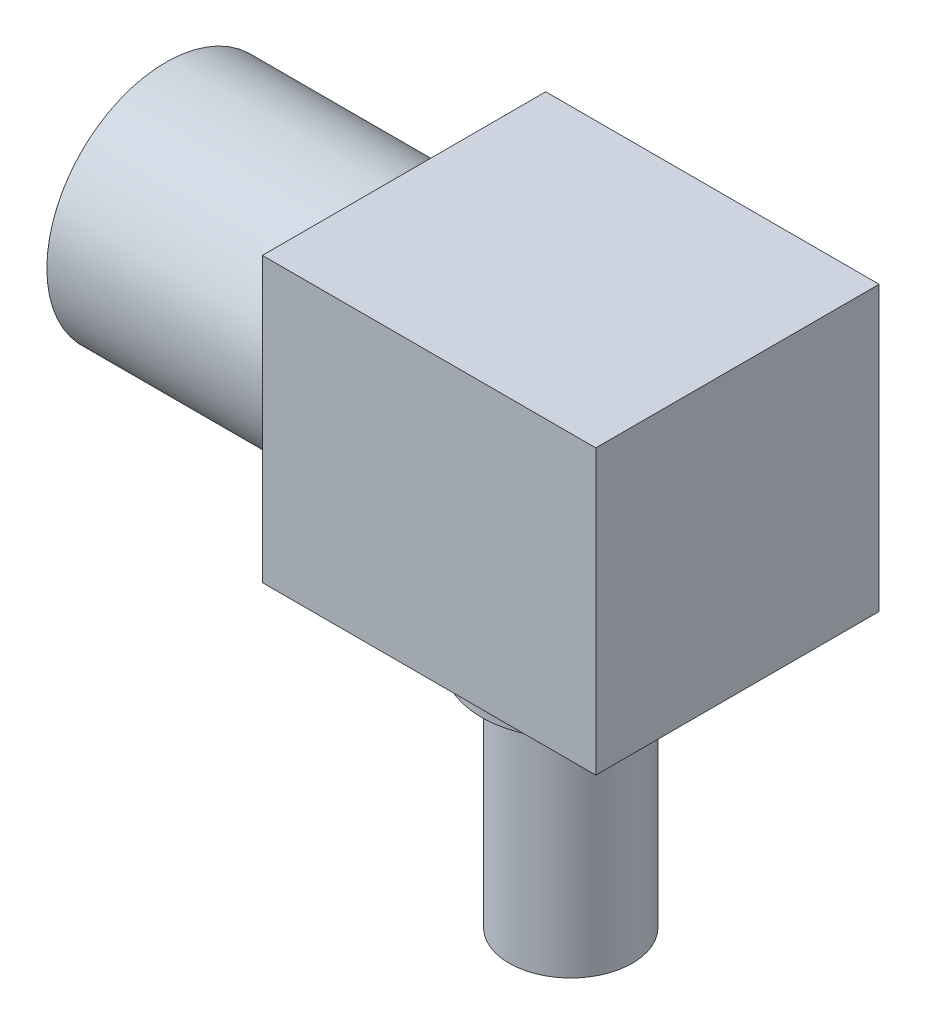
from build123d import *

# Parameters (mm, degrees)
SKETCH2_R          = 7.5
EXTRUDE1_DEPTH     = 5
SKETCH4_R          = 5.175160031
THREADS_DEPTH      = 19.05
SKETCH8_W          = 23.8
SKETCH8_H          = 23.8
EXTRUDE3_DEPTH     = 14
SKETCH9_R          = 10
EXTRUDE4_DEPTH     = 20
SKETCH10_R         = 0.703214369
CUT_EXTRUDE3_DEPTH = 10
CIRPATTERN3_COUNT  = 8


with BuildPart() as part:
    # Sketch2 → Extrude1 (new body)
    with BuildSketch(Plane(origin=(0, 0, 0), x_dir=(1, 0, 0), z_dir=(0, 1, 0))):
        with Locations(Location((0, 0, 0), (0, 0, 270))):
            Circle(SKETCH2_R)
    extrude(amount=EXTRUDE1_DEPTH)

    # Sketch4 → THREADS (add)
    with BuildSketch(Plane.XZ):
        with Locations(Location((0, 0, 0), (0, 0, 90))):
            Circle(SKETCH4_R)
    extrude(amount=THREADS_DEPTH)

    # Sketch8 → Extrude3 (add, symmetric)
    with BuildSketch(Plane(origin=(0, 0, 0), x_dir=(0, 0, -1), z_dir=(1, 0, 0))):
        with Locations((0, 16.9)):
            Rectangle(SKETCH8_W, SKETCH8_H)
    extrude(amount=EXTRUDE3_DEPTH, both=True)

    # Sketch9 → Extrude4 (add)
    with BuildSketch(Plane.ZY.offset(14)):
        with Locations((0, 16.9)):
            Circle(SKETCH9_R)
    extrude(amount=EXTRUDE4_DEPTH)

    # Sketch10 → Cut-Extrude3 (cut)
    with BuildSketch(Plane.ZY.offset(34)):
        with Locations((8, 16.9)):
            Circle(SKETCH10_R)
    cut_extrude3 = extrude(amount=-CUT_EXTRUDE3_DEPTH, mode=Mode.SUBTRACT)

    # CirPattern3: Cut-Extrude3 ×8 about axis
    cirpattern3_axis = Axis((0, 16.9, 0), (1, 0, 0))
    for i in range(1, CIRPATTERN3_COUNT):
        add(cut_extrude3.rotate(cirpattern3_axis, i * 360 / CIRPATTERN3_COUNT), mode=Mode.SUBTRACT)


solid = part.part
